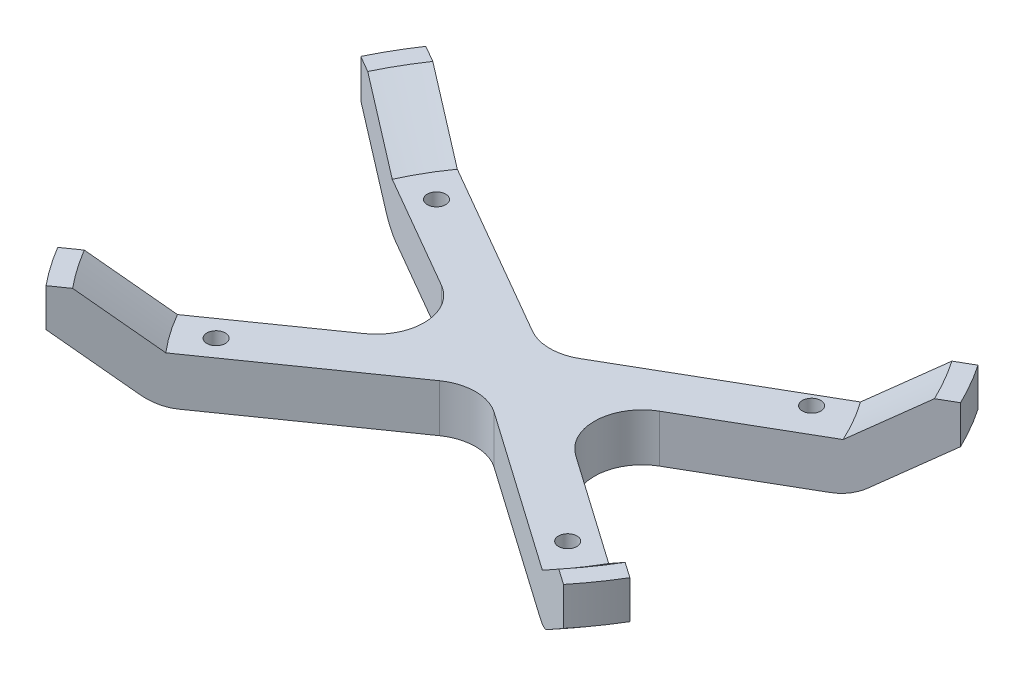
from build123d import *

# Parameters (mm, degrees)
BOSS_EXTRUDE2_DEPTH                            = 25.4
FILLET1_R                                      = 12.7
CBORE_FOR_8_SOCKET_HEAD_CAP_SCREW2_D           = 4.9149
CBORE_FOR_8_SOCKET_HEAD_CAP_SCREW2_CBORE_D     = 7.9375
CBORE_FOR_8_SOCKET_HEAD_CAP_SCREW2_CBORE_DEPTH = 5.4356


with BuildPart() as part:
    # Sketch1 → Boss-Extrude2 (new body)
    with BuildSketch(Plane.XZ):
        with BuildLine():
            Line((-79.968005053, -38.837200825), (-11.807111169, 0.515509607))
            Line((-11.807111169, 0.515509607), (-76.278817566, 45.659084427))
            ThreePointArc((-76.278817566, 45.659084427), (-72.822616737, 50.990945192), (-68.994396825, 56.062315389))
            Line((-68.994396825, 56.062315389), (0, 7.751918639))
            Line((0, 7.751918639), (68.994396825, 56.062315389))
            ThreePointArc((68.994396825, 56.062315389), (72.822616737, 50.990945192), (76.278817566, 45.659084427))
            Line((76.278817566, 45.659084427), (11.807111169, 0.515509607))
            Line((11.807111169, 0.515509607), (79.968005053, -38.837200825))
            ThreePointArc((79.968005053, -38.837200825), (76.989658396, -44.45), (73.618005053, -49.835723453))
            Line((73.618005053, -49.835723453), (0, -7.332348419))
            Line((0, -7.332348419), (-73.618005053, -49.835723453))
            ThreePointArc((-73.618005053, -49.835723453), (-76.989658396, -44.45), (-79.968005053, -38.837200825))
        make_face()
    extrude(amount=BOSS_EXTRUDE2_DEPTH)

    # Sketch9 → Cut-Revolve1 (revolve, cut)
    with BuildSketch(Plane(origin=(0, 0, 0), x_dir=(-0.8660254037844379, 0, -0.5000000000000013), z_dir=(0.5000000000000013, 0, -0.8660254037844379))):
        Polygon((83.82, 0), (66.04, -12.7), (0, -12.7), (0, 10.342327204), (83.82, 10.342327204), align=None)
        Polygon((88.9, -10.16), (67.564, -25.4), (95.721561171, -25.4), (95.721561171, -10.16), align=None)
    revolve(axis=Axis((0, 97.79, 0), (0, -1, 0)), mode=Mode.SUBTRACT)

    # Fillet1
    fillet1_edges = [part.edges().sort_by_distance(p)[0] for p in [
        (-11.807111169, -19.05, 0.515509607),
        (0, -19.05, 7.751918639),
        (11.807111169, -19.05, 0.515509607),
        (0, -19.05, -7.332348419),
        (-58.512140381, -25.4, -33.782),
        (58.512140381, -25.4, -33.782),
        (55.34518872, -25.4, 38.753118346),
        (-55.34518872, -25.4, 38.753118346),
    ]]
    fillet(fillet1_edges, radius=FILLET1_R)

    # CBORE for _8 Socket Head Cap Screw2 (through all)
    with Locations(Plane(origin=(0, -25.4, 0), x_dir=(-1, 0, 0), z_dir=(0, -1, 0))):
        with Locations((-48.109154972, 30.983896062), (-46.874486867, -32.821869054), (49.556729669, 28.611591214), (46.874486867, -32.821869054)):
            CounterBoreHole(CBORE_FOR_8_SOCKET_HEAD_CAP_SCREW2_D / 2, CBORE_FOR_8_SOCKET_HEAD_CAP_SCREW2_CBORE_D / 2, CBORE_FOR_8_SOCKET_HEAD_CAP_SCREW2_CBORE_DEPTH)


solid = part.part
